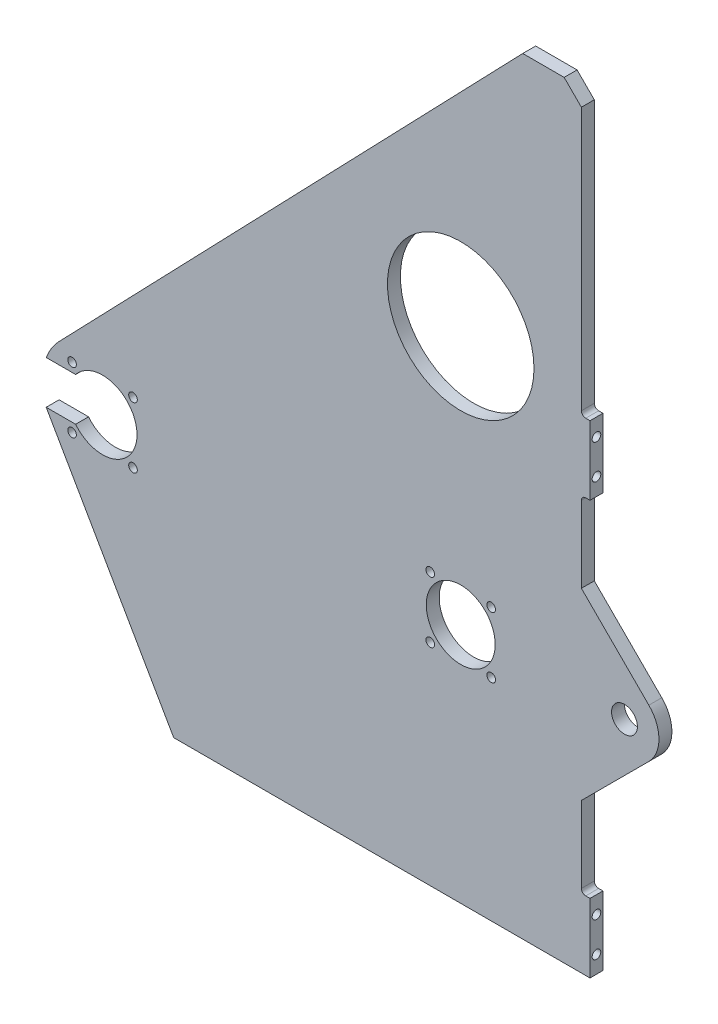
from build123d import *

# Parameters (mm, degrees)
ESQUISSE1_R                      = 40
ESQUISSE1_R_2                    = 15
ESQUISSE1_R_3                    = 85
BASE_EXTRUSION_DEPTH             = 15
CHANFREIN1_SIZE                  = 20
TROU_TARAUD_M10X1_51_D           = 8.5
TROU_TARAUD_M10X1_51_CBORE_D     = 10
TROU_TARAUD_M10X1_51_CBORE_DEPTH = 20
TROU_TARAUD_M10X1_52_D           = 8.5
TROU_TARAUD_M10X1_52_CBORE_D     = 10
TROU_TARAUD_M10X1_52_CBORE_DEPTH = 20
TROU_TARAUD_M10X1_53_AT_2_COUNT  = 2
TROU_TARAUD_M10X1_53_AT_2_PITCH  = 40
TROU_TARAUD_M10X1_53_AT_3_COUNT  = 2
TROU_TARAUD_M10X1_53_AT_3_PITCH  = 480
TROU_TARAUD_M10X1_53_AT_4_COUNT  = 2
TROU_TARAUD_M10X1_53_AT_4_PITCH  = 520


with BuildPart() as part:
    # Esquisse1 → Base-Extrusion (new body)
    with BuildSketch(Plane.XY):
        with BuildLine():
            Line((-333.06, -280), (150, -280))
            Line((150, -280), (150, -200))
            Line((150, -200), (145, -200))
            ThreePointArc((145, -200), (141.464466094, -198.535533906), (140, -195))
            Line((140, -195), (140, -106.568542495))
            Line((140, -106.568542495), (218.284271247, -28.284271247))
            ThreePointArc((218.284271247, -28.284271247), (230, 0), (218.284271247, 28.284271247))
            Line((218.284271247, 28.284271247), (140, 106.568542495))
            Line((140, 106.568542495), (140, 195))
            ThreePointArc((140, 195), (141.464466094, 198.535533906), (145, 200))
            Line((145, 200), (150, 200))
            Line((150, 200), (150, 280))
            Line((150, 280), (145, 280))
            ThreePointArc((145, 280), (141.464466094, 281.464466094), (140, 285))
            Line((140, 285), (140, 610))
            Line((140, 610), (71.95, 610))
            Line((71.95, 610), (-466.031583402, 51.576163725))
            ThreePointArc((-466.031583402, 51.576163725), (-474.704392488, 40.547109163), (-481.003484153, 28.01))
            Line((-481.003484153, 28.01), (-446.844989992, 28.01))
            ThreePointArc((-446.844989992, 28.01), (-375.62, 3.01), (-446.844989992, -21.99))
            Line((-446.844989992, -21.99), (-481.004989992, -21.99))
            Line((-481.004989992, -21.99), (-333.06, -280))
        make_face()
        Circle(ESQUISSE1_R, mode=Mode.SUBTRACT)
        with Locations((190, 0)):
            Circle(ESQUISSE1_R_2, mode=Mode.SUBTRACT)
        with Locations((0, 300)):
            Circle(ESQUISSE1_R_3, mode=Mode.SUBTRACT)
    extrude(amount=BASE_EXTRUSION_DEPTH)

    # Chanfrein1
    chanfrein1_edges = [part.edges().sort_by_distance(p)[0] for p in [
        (140, 610, 7.5),
    ]]
    chamfer(chanfrein1_edges, length=CHANFREIN1_SIZE)

    # Trou taraud_ M10x1.51 (through all)
    with Locations(Plane(origin=(-35.355339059, 35.355339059, 15), x_dir=(1, 0, 0), z_dir=(0, 0, 1))):
        with Locations((0, 0), (0, -70.710678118), (70.710678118, -70.710678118), (70.710678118, 0)):
            CounterBoreHole(TROU_TARAUD_M10X1_51_D / 2, TROU_TARAUD_M10X1_51_CBORE_D / 2, TROU_TARAUD_M10X1_51_CBORE_DEPTH)

    # Trou taraud_ M10x1.52 (through all)
    with Locations(Plane(origin=(-380.264660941, 38.365339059, 15), x_dir=(1, 0, 0), z_dir=(0, 0, 1))):
        with Locations((0, 0), (0, -70.710678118), (-70.710678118, -70.710678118), (-70.710678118, 0)):
            CounterBoreHole(TROU_TARAUD_M10X1_52_D / 2, TROU_TARAUD_M10X1_52_CBORE_D / 2, TROU_TARAUD_M10X1_52_CBORE_DEPTH)

    # Esquisse7 → Trou taraud_ M10x1.53 (revolve, cut)
    with BuildSketch(Plane(origin=(150, -260, 7.5), x_dir=(0, 0, -1), z_dir=(0, 1, 0))):
        Polygon((0, 0), (0, 21.053657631), (4.25, 18.5), (4.25, 20), (5, 20), (5, 0), align=None)
    trou_taraud_m10x1_53 = revolve(axis=Axis((156.35, -260, 7.5), (-1, 0, 0)), mode=Mode.SUBTRACT)

    # Trou taraud_ M10x1.53 at 2: Trou taraud_ M10x1.53 ×2
    with Locations(*[(0, i * TROU_TARAUD_M10X1_53_AT_2_PITCH, 0) for i in range(1, TROU_TARAUD_M10X1_53_AT_2_COUNT)]):
        add(trou_taraud_m10x1_53, mode=Mode.SUBTRACT)

    # Trou taraud_ M10x1.53 at 3: Trou taraud_ M10x1.53 ×2
    with Locations(*[(0, i * TROU_TARAUD_M10X1_53_AT_3_PITCH, 0) for i in range(1, TROU_TARAUD_M10X1_53_AT_3_COUNT)]):
        add(trou_taraud_m10x1_53, mode=Mode.SUBTRACT)

    # Trou taraud_ M10x1.53 at 4: Trou taraud_ M10x1.53 ×2
    with Locations(*[(0, i * TROU_TARAUD_M10X1_53_AT_4_PITCH, 0) for i in range(1, TROU_TARAUD_M10X1_53_AT_4_COUNT)]):
        add(trou_taraud_m10x1_53, mode=Mode.SUBTRACT)


solid = part.part
